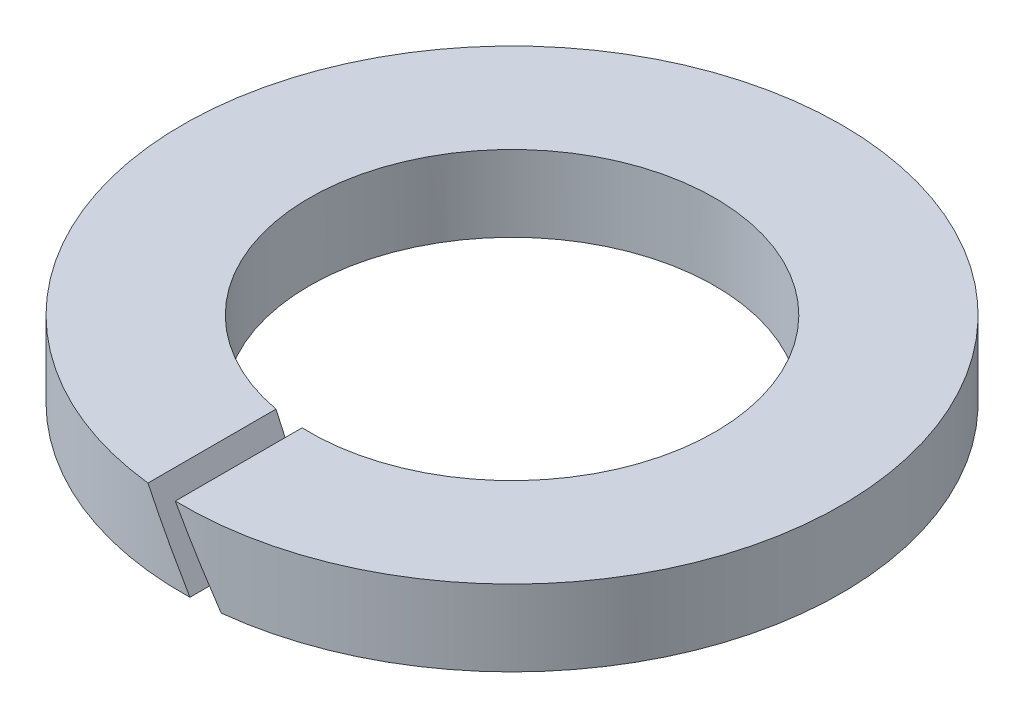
ISO-10303-21;
HEADER;
FILE_DESCRIPTION(('STEP AP214'),'2;1');
FILE_NAME('part.step','',(''),(''),'','','');
FILE_SCHEMA(('AUTOMOTIVE_DESIGN { 1 0 10303 214 1 1 1 1 }'));
ENDSEC;
DATA;
#1=APPLICATION_CONTEXT('core data for automotive mechanical design processes');
#2=APPLICATION_PROTOCOL_DEFINITION('international standard','automotive_design',2000,#1);
#3=PRODUCT_CONTEXT('',#1,'mechanical');
#4=PRODUCT('Part','Part','',(#3));
#5=PRODUCT_RELATED_PRODUCT_CATEGORY('part','',(#4));
#6=PRODUCT_DEFINITION_FORMATION('','',#4);
#7=PRODUCT_DEFINITION_CONTEXT('part definition',#1,'design');
#8=PRODUCT_DEFINITION('design','',#6,#7);
#9=PRODUCT_DEFINITION_SHAPE('','',#8);
#10=(LENGTH_UNIT() NAMED_UNIT(*) SI_UNIT(.MILLI.,.METRE.));
#11=(NAMED_UNIT(*) PLANE_ANGLE_UNIT() SI_UNIT($,.RADIAN.));
#12=(NAMED_UNIT(*) SI_UNIT($,.STERADIAN.) SOLID_ANGLE_UNIT());
#13=UNCERTAINTY_MEASURE_WITH_UNIT(LENGTH_MEASURE(1.E-05),#10,'distance_accuracy_value','');
#14=(GEOMETRIC_REPRESENTATION_CONTEXT(3) GLOBAL_UNCERTAINTY_ASSIGNED_CONTEXT((#13)) GLOBAL_UNIT_ASSIGNED_CONTEXT((#10,
#11,#12)) REPRESENTATION_CONTEXT('',''));
#15=CARTESIAN_POINT('',(0.,0.,0.));
#16=DIRECTION('',(0.,0.,1.));
#17=DIRECTION('',(1.,0.,0.));
#18=AXIS2_PLACEMENT_3D('',#15,#16,#17);
#19=CARTESIAN_POINT('',(0.,80.,0.));
#20=DIRECTION('',(0.,1.,0.));
#21=DIRECTION('',(0.,0.,1.));
#22=AXIS2_PLACEMENT_3D('',#19,#20,#21);
#23=CYLINDRICAL_SURFACE('',#22,3.20000000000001);
#24=CARTESIAN_POINT('',(0.,0.399999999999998,0.));
#25=DIRECTION('',(-0.866025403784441,-0.499999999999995,0.));
#26=DIRECTION('',(-0.499999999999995,0.866025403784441,0.));
#27=AXIS2_PLACEMENT_3D('',#24,#25,#26);
#28=ELLIPSE('',#27,6.40000000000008,3.20000000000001);
#29=CARTESIAN_POINT('',(0.577350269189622,-0.600000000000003,3.14748576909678));
#30=VERTEX_POINT('',#29);
#31=CARTESIAN_POINT('',(-0.115470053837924,0.600000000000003,3.1979159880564));
#32=VERTEX_POINT('',#31);
#33=EDGE_CURVE('E86',#30,#32,#28,.T.);
#34=ORIENTED_EDGE('',*,*,#33,.T.);
#35=CARTESIAN_POINT('',(0.,0.600000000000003,0.));
#36=DIRECTION('',(0.,1.,0.));
#37=DIRECTION('',(0.,0.,1.));
#38=AXIS2_PLACEMENT_3D('',#35,#36,#37);
#39=CIRCLE('',#38,3.20000000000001);
#40=CARTESIAN_POINT('',(-0.577350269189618,0.600000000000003,3.14748576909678));
#41=VERTEX_POINT('',#40);
#42=EDGE_CURVE('E90',#32,#41,#39,.T.);
#43=ORIENTED_EDGE('',*,*,#42,.T.);
#44=CARTESIAN_POINT('',(0.,-0.399999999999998,0.));
#45=DIRECTION('',(-0.866025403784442,-0.499999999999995,0.));
#46=DIRECTION('',(-0.499999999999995,0.866025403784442,0.));
#47=AXIS2_PLACEMENT_3D('',#44,#45,#46);
#48=ELLIPSE('',#47,6.40000000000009,3.20000000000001);
#49=CARTESIAN_POINT('',(0.115470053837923,-0.600000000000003,3.1979159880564));
#50=VERTEX_POINT('',#49);
#51=EDGE_CURVE('E46',#50,#41,#48,.T.);
#52=ORIENTED_EDGE('',*,*,#51,.F.);
#53=CARTESIAN_POINT('',(0.,-0.600000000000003,0.));
#54=DIRECTION('',(0.,1.,0.));
#55=DIRECTION('',(0.,0.,1.));
#56=AXIS2_PLACEMENT_3D('',#53,#54,#55);
#57=CIRCLE('',#56,3.20000000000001);
#58=EDGE_CURVE('E11',#30,#50,#57,.T.);
#59=ORIENTED_EDGE('',*,*,#58,.F.);
#60=EDGE_LOOP('',(#34,#43,#52,#59));
#61=FACE_BOUND('',#60,.T.);
#62=ADVANCED_FACE('F32',(#61),#23,.F.);
#63=CARTESIAN_POINT('',(5.20000000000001,-0.6,0.));
#64=DIRECTION('',(0.,-1.,0.));
#65=DIRECTION('',(0.,0.,-1.));
#66=AXIS2_PLACEMENT_3D('',#63,#64,#65);
#67=PLANE('',#66);
#68=CARTESIAN_POINT('',(0.,-0.600000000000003,0.));
#69=DIRECTION('',(0.,1.,0.));
#70=DIRECTION('',(0.,0.,1.));
#71=AXIS2_PLACEMENT_3D('',#68,#69,#70);
#72=CIRCLE('',#71,5.20000000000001);
#73=CARTESIAN_POINT('',(0.577350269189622,-0.600000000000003,5.16784932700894));
#74=VERTEX_POINT('',#73);
#75=CARTESIAN_POINT('',(0.115470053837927,-0.600000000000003,5.19871779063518));
#76=VERTEX_POINT('',#75);
#77=EDGE_CURVE('E39',#74,#76,#72,.T.);
#78=ORIENTED_EDGE('',*,*,#77,.F.);
#79=DIRECTION('',(0.,0.,-1.));
#80=VECTOR('',#79,1.);
#81=CARTESIAN_POINT('',(0.577350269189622,-0.600000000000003,5.20100000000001));
#82=LINE('',#81,#80);
#83=EDGE_CURVE('E79',#74,#30,#82,.T.);
#84=ORIENTED_EDGE('',*,*,#83,.T.);
#85=ORIENTED_EDGE('',*,*,#58,.T.);
#86=DIRECTION('',(0.,0.,-1.));
#87=VECTOR('',#86,1.);
#88=CARTESIAN_POINT('',(0.115470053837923,-0.600000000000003,5.20100000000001));
#89=LINE('',#88,#87);
#90=EDGE_CURVE('E73',#76,#50,#89,.T.);
#91=ORIENTED_EDGE('',*,*,#90,.F.);
#92=EDGE_LOOP('',(#78,#84,#85,#91));
#93=FACE_BOUND('',#92,.T.);
#94=ADVANCED_FACE('F83',(#93),#67,.T.);
#95=CARTESIAN_POINT('',(0.,80.,0.));
#96=DIRECTION('',(0.,1.,0.));
#97=DIRECTION('',(0.,0.,1.));
#98=AXIS2_PLACEMENT_3D('',#95,#96,#97);
#99=CYLINDRICAL_SURFACE('',#98,5.20000000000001);
#100=CARTESIAN_POINT('',(0.,0.399999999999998,0.));
#101=DIRECTION('',(-0.866025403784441,-0.499999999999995,0.));
#102=DIRECTION('',(-0.499999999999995,0.866025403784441,0.));
#103=AXIS2_PLACEMENT_3D('',#100,#101,#102);
#104=ELLIPSE('',#103,10.4000000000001,5.20000000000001);
#105=CARTESIAN_POINT('',(-0.115470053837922,0.600000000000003,5.19871779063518));
#106=VERTEX_POINT('',#105);
#107=EDGE_CURVE('E54',#106,#74,#104,.F.);
#108=ORIENTED_EDGE('',*,*,#107,.T.);
#109=ORIENTED_EDGE('',*,*,#77,.T.);
#110=CARTESIAN_POINT('',(0.,-0.399999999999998,0.));
#111=DIRECTION('',(-0.866025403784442,-0.499999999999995,0.));
#112=DIRECTION('',(-0.499999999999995,0.866025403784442,0.));
#113=AXIS2_PLACEMENT_3D('',#110,#111,#112);
#114=ELLIPSE('',#113,10.4000000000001,5.20000000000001);
#115=CARTESIAN_POINT('',(-0.577350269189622,0.600000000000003,5.16784932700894));
#116=VERTEX_POINT('',#115);
#117=EDGE_CURVE('E70',#116,#76,#114,.F.);
#118=ORIENTED_EDGE('',*,*,#117,.F.);
#119=CARTESIAN_POINT('',(0.,0.600000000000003,0.));
#120=DIRECTION('',(0.,1.,0.));
#121=DIRECTION('',(0.,0.,1.));
#122=AXIS2_PLACEMENT_3D('',#119,#120,#121);
#123=CIRCLE('',#122,5.20000000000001);
#124=EDGE_CURVE('E89',#106,#116,#123,.T.);
#125=ORIENTED_EDGE('',*,*,#124,.F.);
#126=EDGE_LOOP('',(#108,#109,#118,#125));
#127=FACE_BOUND('',#126,.T.);
#128=ADVANCED_FACE('F88',(#127),#99,.T.);
#129=CARTESIAN_POINT('',(3.20000000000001,0.6,0.));
#130=DIRECTION('',(0.,1.,0.));
#131=DIRECTION('',(0.,0.,1.));
#132=AXIS2_PLACEMENT_3D('',#129,#130,#131);
#133=PLANE('',#132);
#134=ORIENTED_EDGE('',*,*,#42,.F.);
#135=DIRECTION('',(0.,0.,-1.));
#136=VECTOR('',#135,1.);
#137=CARTESIAN_POINT('',(-0.115470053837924,0.600000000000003,5.20100000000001));
#138=LINE('',#137,#136);
#139=EDGE_CURVE('E97',#106,#32,#138,.T.);
#140=ORIENTED_EDGE('',*,*,#139,.F.);
#141=ORIENTED_EDGE('',*,*,#124,.T.);
#142=DIRECTION('',(0.,0.,-1.));
#143=VECTOR('',#142,1.);
#144=CARTESIAN_POINT('',(-0.577350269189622,0.600000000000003,5.20100000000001));
#145=LINE('',#144,#143);
#146=EDGE_CURVE('E74',#116,#41,#145,.T.);
#147=ORIENTED_EDGE('',*,*,#146,.T.);
#148=EDGE_LOOP('',(#134,#140,#141,#147));
#149=FACE_BOUND('',#148,.T.);
#150=ADVANCED_FACE('F105',(#149),#133,.T.);
#151=CARTESIAN_POINT('',(0.115470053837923,-0.600000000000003,5.20100000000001));
#152=DIRECTION('',(-0.866025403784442,-0.499999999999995,0.));
#153=DIRECTION('',(0.499999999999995,-0.866025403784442,0.));
#154=AXIS2_PLACEMENT_3D('',#151,#152,#153);
#155=PLANE('',#154);
#156=ORIENTED_EDGE('',*,*,#51,.T.);
#157=ORIENTED_EDGE('',*,*,#146,.F.);
#158=ORIENTED_EDGE('',*,*,#117,.T.);
#159=ORIENTED_EDGE('',*,*,#90,.T.);
#160=EDGE_LOOP('',(#156,#157,#158,#159));
#161=FACE_BOUND('',#160,.T.);
#162=ADVANCED_FACE('F72',(#161),#155,.F.);
#163=CARTESIAN_POINT('',(0.577350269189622,-0.600000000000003,5.20100000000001));
#164=DIRECTION('',(-0.866025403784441,-0.499999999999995,0.));
#165=DIRECTION('',(0.499999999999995,-0.866025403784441,0.));
#166=AXIS2_PLACEMENT_3D('',#163,#164,#165);
#167=PLANE('',#166);
#168=ORIENTED_EDGE('',*,*,#83,.F.);
#169=ORIENTED_EDGE('',*,*,#107,.F.);
#170=ORIENTED_EDGE('',*,*,#139,.T.);
#171=ORIENTED_EDGE('',*,*,#33,.F.);
#172=EDGE_LOOP('',(#168,#169,#170,#171));
#173=FACE_BOUND('',#172,.T.);
#174=ADVANCED_FACE('F106',(#173),#167,.T.);
#175=CLOSED_SHELL('',(#62,#94,#128,#150,#162,#174));
#176=MANIFOLD_SOLID_BREP('B2',#175);
#177=ADVANCED_BREP_SHAPE_REPRESENTATION('',(#18,#176),#14);
#178=SHAPE_DEFINITION_REPRESENTATION(#9,#177);
ENDSEC;
END-ISO-10303-21;
